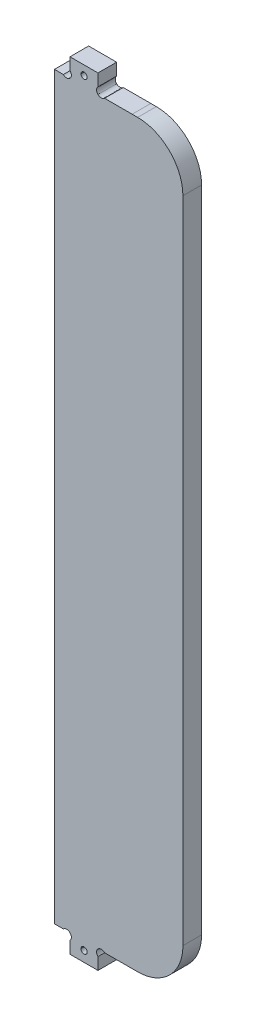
ISO-10303-21;
HEADER;
FILE_DESCRIPTION(('STEP AP214'),'2;1');
FILE_NAME('part.step','',(''),(''),'','','');
FILE_SCHEMA(('AUTOMOTIVE_DESIGN { 1 0 10303 214 1 1 1 1 }'));
ENDSEC;
DATA;
#1=APPLICATION_CONTEXT('core data for automotive mechanical design processes');
#2=APPLICATION_PROTOCOL_DEFINITION('international standard','automotive_design',2000,#1);
#3=PRODUCT_CONTEXT('',#1,'mechanical');
#4=PRODUCT('Part','Part','',(#3));
#5=PRODUCT_RELATED_PRODUCT_CATEGORY('part','',(#4));
#6=PRODUCT_DEFINITION_FORMATION('','',#4);
#7=PRODUCT_DEFINITION_CONTEXT('part definition',#1,'design');
#8=PRODUCT_DEFINITION('design','',#6,#7);
#9=PRODUCT_DEFINITION_SHAPE('','',#8);
#10=(LENGTH_UNIT() NAMED_UNIT(*) SI_UNIT(.MILLI.,.METRE.));
#11=(NAMED_UNIT(*) PLANE_ANGLE_UNIT() SI_UNIT($,.RADIAN.));
#12=(NAMED_UNIT(*) SI_UNIT($,.STERADIAN.) SOLID_ANGLE_UNIT());
#13=UNCERTAINTY_MEASURE_WITH_UNIT(LENGTH_MEASURE(1.E-05),#10,'distance_accuracy_value','');
#14=(GEOMETRIC_REPRESENTATION_CONTEXT(3) GLOBAL_UNCERTAINTY_ASSIGNED_CONTEXT((#13)) GLOBAL_UNIT_ASSIGNED_CONTEXT((#10,
#11,#12)) REPRESENTATION_CONTEXT('',''));
#15=CARTESIAN_POINT('',(0.,0.,0.));
#16=DIRECTION('',(0.,0.,1.));
#17=DIRECTION('',(1.,0.,0.));
#18=AXIS2_PLACEMENT_3D('',#15,#16,#17);
#19=CARTESIAN_POINT('',(2432.48436921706,-179.23610385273,6.));
#20=CARTESIAN_POINT('',(2432.48436921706,-178.683819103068,6.));
#21=CARTESIAN_POINT('',(2432.93208446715,-178.23610385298,6.));
#22=CARTESIAN_POINT('',(2434.03665396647,-178.23610385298,6.));
#23=CARTESIAN_POINT('',(2434.48436921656,-178.683819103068,6.));
#24=CARTESIAN_POINT('',(2434.48436921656,-179.23610385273,6.));
#25=B_SPLINE_CURVE_WITH_KNOTS('',3,(#19,#20,#21,#22,#23,#24),.UNSPECIFIED.,.F.,.F.,(4,2,4),(2.,
3.,4.),.UNSPECIFIED.);
#26=DIRECTION('',(0.,0.,-1.));
#27=VECTOR('',#26,1.);
#28=SURFACE_OF_LINEAR_EXTRUSION('',#25,#27);
#29=CARTESIAN_POINT('',(2432.48436921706,-179.23610385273,0.));
#30=CARTESIAN_POINT('',(2432.48436921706,-178.683819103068,0.));
#31=CARTESIAN_POINT('',(2432.93208446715,-178.23610385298,0.));
#32=CARTESIAN_POINT('',(2434.03665396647,-178.23610385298,0.));
#33=CARTESIAN_POINT('',(2434.48436921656,-178.683819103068,0.));
#34=CARTESIAN_POINT('',(2434.48436921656,-179.23610385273,0.));
#35=B_SPLINE_CURVE_WITH_KNOTS('',3,(#29,#30,#31,#32,#33,#34),.UNSPECIFIED.,.F.,.F.,(4,2,4),(2.,
3.,4.),.UNSPECIFIED.);
#36=CARTESIAN_POINT('',(2432.48436921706,-179.23610385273,0.));
#37=VERTEX_POINT('',#36);
#38=CARTESIAN_POINT('',(2434.48436921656,-179.23610385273,0.));
#39=VERTEX_POINT('',#38);
#40=EDGE_CURVE('E316',#37,#39,#35,.T.);
#41=ORIENTED_EDGE('',*,*,#40,.T.);
#42=DIRECTION('',(0.,0.,-1.));
#43=VECTOR('',#42,1.);
#44=CARTESIAN_POINT('',(2434.48436921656,-179.23610385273,6.));
#45=LINE('',#44,#43);
#46=CARTESIAN_POINT('',(2434.48436921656,-179.23610385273,6.));
#47=VERTEX_POINT('',#46);
#48=EDGE_CURVE('E11',#47,#39,#45,.T.);
#49=ORIENTED_EDGE('',*,*,#48,.F.);
#50=CARTESIAN_POINT('',(2432.48436921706,-179.23610385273,6.));
#51=VERTEX_POINT('',#50);
#52=EDGE_CURVE('E231',#51,#47,#25,.T.);
#53=ORIENTED_EDGE('',*,*,#52,.F.);
#54=DIRECTION('',(0.,0.,-1.));
#55=VECTOR('',#54,1.);
#56=CARTESIAN_POINT('',(2432.48436921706,-179.23610385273,6.));
#57=LINE('',#56,#55);
#58=EDGE_CURVE('E47',#51,#37,#57,.T.);
#59=ORIENTED_EDGE('',*,*,#58,.T.);
#60=EDGE_LOOP('',(#41,#49,#53,#59));
#61=FACE_BOUND('',#60,.T.);
#62=ADVANCED_FACE('F36',(#61),#28,.F.);
#63=CARTESIAN_POINT('',(2432.48436921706,64.4111833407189,6.));
#64=CARTESIAN_POINT('',(2432.48436921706,64.9634680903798,6.));
#65=CARTESIAN_POINT('',(2432.93208446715,65.411183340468,6.));
#66=CARTESIAN_POINT('',(2434.03665396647,65.411183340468,6.));
#67=CARTESIAN_POINT('',(2434.48436921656,64.9634680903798,6.));
#68=CARTESIAN_POINT('',(2434.48436921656,64.4111833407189,6.));
#69=B_SPLINE_CURVE_WITH_KNOTS('',3,(#63,#64,#65,#66,#67,#68),.UNSPECIFIED.,.F.,.F.,(4,2,4),(2.,
3.,4.),.UNSPECIFIED.);
#70=DIRECTION('',(0.,0.,-1.));
#71=VECTOR('',#70,1.);
#72=SURFACE_OF_LINEAR_EXTRUSION('',#69,#71);
#73=CARTESIAN_POINT('',(2432.48436921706,64.4111833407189,0.));
#74=CARTESIAN_POINT('',(2432.48436921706,64.9634680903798,0.));
#75=CARTESIAN_POINT('',(2432.93208446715,65.411183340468,0.));
#76=CARTESIAN_POINT('',(2434.03665396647,65.411183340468,0.));
#77=CARTESIAN_POINT('',(2434.48436921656,64.9634680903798,0.));
#78=CARTESIAN_POINT('',(2434.48436921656,64.4111833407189,0.));
#79=B_SPLINE_CURVE_WITH_KNOTS('',3,(#73,#74,#75,#76,#77,#78),.UNSPECIFIED.,.F.,.F.,(4,2,4),(2.,
3.,4.),.UNSPECIFIED.);
#80=CARTESIAN_POINT('',(2432.48436921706,64.4111833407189,0.));
#81=VERTEX_POINT('',#80);
#82=CARTESIAN_POINT('',(2434.48436921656,64.4111833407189,0.));
#83=VERTEX_POINT('',#82);
#84=EDGE_CURVE('E528',#81,#83,#79,.T.);
#85=ORIENTED_EDGE('',*,*,#84,.T.);
#86=DIRECTION('',(0.,0.,-1.));
#87=VECTOR('',#86,1.);
#88=CARTESIAN_POINT('',(2434.48436921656,64.4111833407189,6.));
#89=LINE('',#88,#87);
#90=CARTESIAN_POINT('',(2434.48436921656,64.4111833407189,6.));
#91=VERTEX_POINT('',#90);
#92=EDGE_CURVE('E240',#91,#83,#89,.T.);
#93=ORIENTED_EDGE('',*,*,#92,.F.);
#94=CARTESIAN_POINT('',(2432.48436921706,64.4111833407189,6.));
#95=VERTEX_POINT('',#94);
#96=EDGE_CURVE('E227',#95,#91,#69,.T.);
#97=ORIENTED_EDGE('',*,*,#96,.F.);
#98=DIRECTION('',(0.,0.,-1.));
#99=VECTOR('',#98,1.);
#100=CARTESIAN_POINT('',(2432.48436921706,64.4111833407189,6.));
#101=LINE('',#100,#99);
#102=EDGE_CURVE('E234',#95,#81,#101,.T.);
#103=ORIENTED_EDGE('',*,*,#102,.T.);
#104=EDGE_LOOP('',(#85,#93,#97,#103));
#105=FACE_BOUND('',#104,.T.);
#106=ADVANCED_FACE('F242',(#105),#72,.F.);
#107=CARTESIAN_POINT('',(2440.0769720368,61.4112591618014,6.));
#108=CARTESIAN_POINT('',(2439.49117661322,60.8254206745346,6.));
#109=CARTESIAN_POINT('',(2438.54142838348,60.8254206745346,6.));
#110=CARTESIAN_POINT('',(2437.95565449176,61.4112591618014,6.));
#111=B_SPLINE_CURVE_WITH_KNOTS('',3,(#107,#108,#109,#110),.UNSPECIFIED.,.F.,.F.,(4,4),(27.,28.),.UNSPECIFIED.);
#112=DIRECTION('',(0.,0.,-1.));
#113=VECTOR('',#112,1.);
#114=SURFACE_OF_LINEAR_EXTRUSION('',#111,#113);
#115=CARTESIAN_POINT('',(2440.0769720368,61.4112591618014,0.));
#116=CARTESIAN_POINT('',(2439.49117661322,60.8254206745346,0.));
#117=CARTESIAN_POINT('',(2438.54142838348,60.8254206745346,0.));
#118=CARTESIAN_POINT('',(2437.95565449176,61.4112591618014,0.));
#119=B_SPLINE_CURVE_WITH_KNOTS('',3,(#115,#116,#117,#118),.UNSPECIFIED.,.F.,.F.,(4,4),(27.,28.),.UNSPECIFIED.);
#120=CARTESIAN_POINT('',(2440.0769720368,61.4112591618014,0.));
#121=VERTEX_POINT('',#120);
#122=CARTESIAN_POINT('',(2437.95565449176,61.4112591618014,0.));
#123=VERTEX_POINT('',#122);
#124=EDGE_CURVE('E431',#121,#123,#119,.T.);
#125=ORIENTED_EDGE('',*,*,#124,.T.);
#126=DIRECTION('',(0.,0.,-1.));
#127=VECTOR('',#126,1.);
#128=CARTESIAN_POINT('',(2437.95565449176,61.4112591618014,6.));
#129=LINE('',#128,#127);
#130=CARTESIAN_POINT('',(2437.95565449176,61.4112591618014,6.));
#131=VERTEX_POINT('',#130);
#132=EDGE_CURVE('E41',#131,#123,#129,.T.);
#133=ORIENTED_EDGE('',*,*,#132,.F.);
#134=CARTESIAN_POINT('',(2440.0769720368,61.4112591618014,6.));
#135=VERTEX_POINT('',#134);
#136=EDGE_CURVE('E313',#135,#131,#111,.T.);
#137=ORIENTED_EDGE('',*,*,#136,.F.);
#138=DIRECTION('',(0.,0.,-1.));
#139=VECTOR('',#138,1.);
#140=CARTESIAN_POINT('',(2440.0769720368,61.4112591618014,6.));
#141=LINE('',#140,#139);
#142=EDGE_CURVE('E303',#135,#121,#141,.T.);
#143=ORIENTED_EDGE('',*,*,#142,.T.);
#144=EDGE_LOOP('',(#125,#133,#137,#143));
#145=FACE_BOUND('',#144,.T.);
#146=ADVANCED_FACE('F38',(#145),#114,.F.);
#147=CARTESIAN_POINT('',(2437.95565449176,61.4112591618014,6.));
#148=CARTESIAN_POINT('',(2437.36985906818,61.9969253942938,6.));
#149=CARTESIAN_POINT('',(2437.36985906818,62.9467382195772,6.));
#150=CARTESIAN_POINT('',(2437.95565449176,63.5324044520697,6.));
#151=B_SPLINE_CURVE_WITH_KNOTS('',3,(#147,#148,#149,#150),.UNSPECIFIED.,.F.,.F.,(4,4),(28.,29.),.UNSPECIFIED.);
#152=DIRECTION('',(0.,0.,-1.));
#153=VECTOR('',#152,1.);
#154=SURFACE_OF_LINEAR_EXTRUSION('',#151,#153);
#155=CARTESIAN_POINT('',(2437.95565449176,61.4112591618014,0.));
#156=CARTESIAN_POINT('',(2437.36985906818,61.9969253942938,0.));
#157=CARTESIAN_POINT('',(2437.36985906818,62.9467382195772,0.));
#158=CARTESIAN_POINT('',(2437.95565449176,63.5324044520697,0.));
#159=B_SPLINE_CURVE_WITH_KNOTS('',3,(#155,#156,#157,#158),.UNSPECIFIED.,.F.,.F.,(4,4),(28.,29.),.UNSPECIFIED.);
#160=CARTESIAN_POINT('',(2437.95565449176,63.5324044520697,0.));
#161=VERTEX_POINT('',#160);
#162=EDGE_CURVE('E438',#123,#161,#159,.T.);
#163=ORIENTED_EDGE('',*,*,#162,.T.);
#164=DIRECTION('',(0.,0.,-1.));
#165=VECTOR('',#164,1.);
#166=CARTESIAN_POINT('',(2437.95565449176,63.5324044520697,6.));
#167=LINE('',#166,#165);
#168=CARTESIAN_POINT('',(2437.95565449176,63.5324044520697,6.));
#169=VERTEX_POINT('',#168);
#170=EDGE_CURVE('E608',#169,#161,#167,.T.);
#171=ORIENTED_EDGE('',*,*,#170,.F.);
#172=EDGE_CURVE('E151',#131,#169,#151,.T.);
#173=ORIENTED_EDGE('',*,*,#172,.F.);
#174=ORIENTED_EDGE('',*,*,#132,.T.);
#175=EDGE_LOOP('',(#163,#171,#173,#174));
#176=FACE_BOUND('',#175,.T.);
#177=ADVANCED_FACE('F332',(#176),#154,.F.);
#178=CARTESIAN_POINT('',(2437.95565449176,0.,6.));
#179=DIRECTION('',(-1.,0.,0.));
#180=DIRECTION('',(0.,0.,1.));
#181=AXIS2_PLACEMENT_3D('',#178,#179,#180);
#182=PLANE('',#181);
#183=DIRECTION('',(0.,1.,0.));
#184=VECTOR('',#183,1.);
#185=CARTESIAN_POINT('',(2437.95565449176,0.,0.));
#186=LINE('',#185,#184);
#187=CARTESIAN_POINT('',(2437.95565449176,67.4112374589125,0.));
#188=VERTEX_POINT('',#187);
#189=EDGE_CURVE('E445',#161,#188,#186,.T.);
#190=ORIENTED_EDGE('',*,*,#189,.T.);
#191=DIRECTION('',(0.,0.,-1.));
#192=VECTOR('',#191,1.);
#193=CARTESIAN_POINT('',(2437.95565449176,67.4112374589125,6.));
#194=LINE('',#193,#192);
#195=CARTESIAN_POINT('',(2437.95565449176,67.4112374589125,6.));
#196=VERTEX_POINT('',#195);
#197=EDGE_CURVE('E606',#196,#188,#194,.T.);
#198=ORIENTED_EDGE('',*,*,#197,.F.);
#199=DIRECTION('',(0.,1.,0.));
#200=VECTOR('',#199,1.);
#201=CARTESIAN_POINT('',(2437.95565449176,0.,6.));
#202=LINE('',#201,#200);
#203=EDGE_CURVE('E314',#169,#196,#202,.T.);
#204=ORIENTED_EDGE('',*,*,#203,.F.);
#205=ORIENTED_EDGE('',*,*,#170,.T.);
#206=EDGE_LOOP('',(#190,#198,#204,#205));
#207=FACE_BOUND('',#206,.T.);
#208=ADVANCED_FACE('F335',(#207),#182,.F.);
#209=CARTESIAN_POINT('',(0.,67.4112374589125,6.));
#210=DIRECTION('',(0.,-1.,0.));
#211=DIRECTION('',(0.,0.,-1.));
#212=AXIS2_PLACEMENT_3D('',#209,#210,#211);
#213=PLANE('',#212);
#214=DIRECTION('',(-1.,0.,0.));
#215=VECTOR('',#214,1.);
#216=CARTESIAN_POINT('',(0.,67.4112374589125,0.));
#217=LINE('',#216,#215);
#218=CARTESIAN_POINT('',(2428.95566551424,67.4112374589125,0.));
#219=VERTEX_POINT('',#218);
#220=EDGE_CURVE('E450',#188,#219,#217,.T.);
#221=ORIENTED_EDGE('',*,*,#220,.T.);
#222=DIRECTION('',(0.,0.,-1.));
#223=VECTOR('',#222,1.);
#224=CARTESIAN_POINT('',(2428.95566551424,67.4112374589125,6.));
#225=LINE('',#224,#223);
#226=CARTESIAN_POINT('',(2428.95566551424,67.4112374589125,6.));
#227=VERTEX_POINT('',#226);
#228=EDGE_CURVE('E603',#227,#219,#225,.T.);
#229=ORIENTED_EDGE('',*,*,#228,.F.);
#230=DIRECTION('',(-1.,0.,0.));
#231=VECTOR('',#230,1.);
#232=CARTESIAN_POINT('',(0.,67.4112374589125,6.));
#233=LINE('',#232,#231);
#234=EDGE_CURVE('E620',#196,#227,#233,.T.);
#235=ORIENTED_EDGE('',*,*,#234,.F.);
#236=ORIENTED_EDGE('',*,*,#197,.T.);
#237=EDGE_LOOP('',(#221,#229,#235,#236));
#238=FACE_BOUND('',#237,.T.);
#239=ADVANCED_FACE('F338',(#238),#213,.F.);
#240=CARTESIAN_POINT('',(2428.95566551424,0.,6.));
#241=DIRECTION('',(1.,0.,0.));
#242=DIRECTION('',(0.,0.,-1.));
#243=AXIS2_PLACEMENT_3D('',#240,#241,#242);
#244=PLANE('',#243);
#245=DIRECTION('',(0.,-1.,0.));
#246=VECTOR('',#245,1.);
#247=CARTESIAN_POINT('',(2428.95566551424,0.,0.));
#248=LINE('',#247,#246);
#249=CARTESIAN_POINT('',(2428.95566551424,63.5324044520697,0.));
#250=VERTEX_POINT('',#249);
#251=EDGE_CURVE('E452',#219,#250,#248,.T.);
#252=ORIENTED_EDGE('',*,*,#251,.T.);
#253=DIRECTION('',(0.,0.,-1.));
#254=VECTOR('',#253,1.);
#255=CARTESIAN_POINT('',(2428.95566551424,63.5324044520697,6.));
#256=LINE('',#255,#254);
#257=CARTESIAN_POINT('',(2428.95566551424,63.5324044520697,6.));
#258=VERTEX_POINT('',#257);
#259=EDGE_CURVE('E600',#258,#250,#256,.T.);
#260=ORIENTED_EDGE('',*,*,#259,.F.);
#261=DIRECTION('',(0.,-1.,0.));
#262=VECTOR('',#261,1.);
#263=CARTESIAN_POINT('',(2428.95566551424,0.,6.));
#264=LINE('',#263,#262);
#265=EDGE_CURVE('E361',#227,#258,#264,.T.);
#266=ORIENTED_EDGE('',*,*,#265,.F.);
#267=ORIENTED_EDGE('',*,*,#228,.T.);
#268=EDGE_LOOP('',(#252,#260,#266,#267));
#269=FACE_BOUND('',#268,.T.);
#270=ADVANCED_FACE('F342',(#269),#244,.F.);
#271=CARTESIAN_POINT('',(2428.95566551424,63.5324044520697,6.));
#272=CARTESIAN_POINT('',(2429.54143940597,62.9467382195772,6.));
#273=CARTESIAN_POINT('',(2429.54143940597,61.9969253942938,6.));
#274=CARTESIAN_POINT('',(2428.95566551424,61.4112591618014,6.));
#275=B_SPLINE_CURVE_WITH_KNOTS('',3,(#271,#272,#273,#274),.UNSPECIFIED.,.F.,.F.,(4,4),(0.,1.),.UNSPECIFIED.);
#276=DIRECTION('',(0.,0.,-1.));
#277=VECTOR('',#276,1.);
#278=SURFACE_OF_LINEAR_EXTRUSION('',#275,#277);
#279=CARTESIAN_POINT('',(2428.95566551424,63.5324044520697,0.));
#280=CARTESIAN_POINT('',(2429.54143940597,62.9467382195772,0.));
#281=CARTESIAN_POINT('',(2429.54143940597,61.9969253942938,0.));
#282=CARTESIAN_POINT('',(2428.95566551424,61.4112591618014,0.));
#283=B_SPLINE_CURVE_WITH_KNOTS('',3,(#279,#280,#281,#282),.UNSPECIFIED.,.F.,.F.,(4,4),(0.,1.),.UNSPECIFIED.);
#284=CARTESIAN_POINT('',(2428.95566551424,61.4112591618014,0.));
#285=VERTEX_POINT('',#284);
#286=EDGE_CURVE('E454',#250,#285,#283,.T.);
#287=ORIENTED_EDGE('',*,*,#286,.T.);
#288=DIRECTION('',(0.,0.,-1.));
#289=VECTOR('',#288,1.);
#290=CARTESIAN_POINT('',(2428.95566551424,61.4112591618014,6.));
#291=LINE('',#290,#289);
#292=CARTESIAN_POINT('',(2428.95566551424,61.4112591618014,6.));
#293=VERTEX_POINT('',#292);
#294=EDGE_CURVE('E597',#293,#285,#291,.T.);
#295=ORIENTED_EDGE('',*,*,#294,.F.);
#296=EDGE_CURVE('E355',#258,#293,#275,.T.);
#297=ORIENTED_EDGE('',*,*,#296,.F.);
#298=ORIENTED_EDGE('',*,*,#259,.T.);
#299=EDGE_LOOP('',(#287,#295,#297,#298));
#300=FACE_BOUND('',#299,.T.);
#301=ADVANCED_FACE('F346',(#300),#278,.F.);
#302=CARTESIAN_POINT('',(2428.95566551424,61.4112591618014,6.));
#303=CARTESIAN_POINT('',(2428.36987009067,60.8254206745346,6.));
#304=CARTESIAN_POINT('',(2427.42012186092,60.8254206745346,6.));
#305=CARTESIAN_POINT('',(2426.83434796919,61.4112591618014,6.));
#306=B_SPLINE_CURVE_WITH_KNOTS('',3,(#302,#303,#304,#305),.UNSPECIFIED.,.F.,.F.,(4,4),(1.,2.),.UNSPECIFIED.);
#307=DIRECTION('',(0.,0.,-1.));
#308=VECTOR('',#307,1.);
#309=SURFACE_OF_LINEAR_EXTRUSION('',#306,#308);
#310=CARTESIAN_POINT('',(2428.95566551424,61.4112591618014,0.));
#311=CARTESIAN_POINT('',(2428.36987009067,60.8254206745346,0.));
#312=CARTESIAN_POINT('',(2427.42012186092,60.8254206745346,0.));
#313=CARTESIAN_POINT('',(2426.83434796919,61.4112591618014,0.));
#314=B_SPLINE_CURVE_WITH_KNOTS('',3,(#310,#311,#312,#313),.UNSPECIFIED.,.F.,.F.,(4,4),(1.,2.),.UNSPECIFIED.);
#315=CARTESIAN_POINT('',(2426.83434796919,61.4112591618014,0.));
#316=VERTEX_POINT('',#315);
#317=EDGE_CURVE('E458',#285,#316,#314,.T.);
#318=ORIENTED_EDGE('',*,*,#317,.T.);
#319=DIRECTION('',(0.,0.,-1.));
#320=VECTOR('',#319,1.);
#321=CARTESIAN_POINT('',(2426.83434796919,61.4112591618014,6.));
#322=LINE('',#321,#320);
#323=CARTESIAN_POINT('',(2426.83434796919,61.4112591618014,6.));
#324=VERTEX_POINT('',#323);
#325=EDGE_CURVE('E594',#324,#316,#322,.T.);
#326=ORIENTED_EDGE('',*,*,#325,.F.);
#327=EDGE_CURVE('E360',#293,#324,#306,.T.);
#328=ORIENTED_EDGE('',*,*,#327,.F.);
#329=ORIENTED_EDGE('',*,*,#294,.T.);
#330=EDGE_LOOP('',(#318,#326,#328,#329));
#331=FACE_BOUND('',#330,.T.);
#332=ADVANCED_FACE('F351',(#331),#309,.F.);
#333=CARTESIAN_POINT('',(0.,61.4112591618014,6.));
#334=DIRECTION('',(0.,-1.,0.));
#335=DIRECTION('',(0.,0.,-1.));
#336=AXIS2_PLACEMENT_3D('',#333,#334,#335);
#337=PLANE('',#336);
#338=DIRECTION('',(-1.,0.,0.));
#339=VECTOR('',#338,1.);
#340=CARTESIAN_POINT('',(0.,61.4112591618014,0.));
#341=LINE('',#340,#339);
#342=CARTESIAN_POINT('',(2423.95566924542,61.4112591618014,0.));
#343=VERTEX_POINT('',#342);
#344=EDGE_CURVE('E465',#316,#343,#341,.T.);
#345=ORIENTED_EDGE('',*,*,#344,.T.);
#346=DIRECTION('',(0.,0.,-1.));
#347=VECTOR('',#346,1.);
#348=CARTESIAN_POINT('',(2423.95566924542,61.4112591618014,6.));
#349=LINE('',#348,#347);
#350=CARTESIAN_POINT('',(2423.95566924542,61.4112591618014,6.));
#351=VERTEX_POINT('',#350);
#352=EDGE_CURVE('E591',#351,#343,#349,.T.);
#353=ORIENTED_EDGE('',*,*,#352,.F.);
#354=DIRECTION('',(-1.,0.,0.));
#355=VECTOR('',#354,1.);
#356=CARTESIAN_POINT('',(0.,61.4112591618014,6.));
#357=LINE('',#356,#355);
#358=EDGE_CURVE('E369',#324,#351,#357,.T.);
#359=ORIENTED_EDGE('',*,*,#358,.F.);
#360=ORIENTED_EDGE('',*,*,#325,.T.);
#361=EDGE_LOOP('',(#345,#353,#359,#360));
#362=FACE_BOUND('',#361,.T.);
#363=ADVANCED_FACE('F405',(#362),#337,.F.);
#364=CARTESIAN_POINT('',(2423.95566924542,0.,6.));
#365=DIRECTION('',(1.,0.,0.));
#366=DIRECTION('',(0.,0.,-1.));
#367=AXIS2_PLACEMENT_3D('',#364,#365,#366);
#368=PLANE('',#367);
#369=DIRECTION('',(0.,-1.,0.));
#370=VECTOR('',#369,1.);
#371=CARTESIAN_POINT('',(2423.95566924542,0.,0.));
#372=LINE('',#371,#370);
#373=CARTESIAN_POINT('',(2423.95566924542,-176.588856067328,0.));
#374=VERTEX_POINT('',#373);
#375=EDGE_CURVE('E470',#343,#374,#372,.T.);
#376=ORIENTED_EDGE('',*,*,#375,.T.);
#377=DIRECTION('',(0.,0.,-1.));
#378=VECTOR('',#377,1.);
#379=CARTESIAN_POINT('',(2423.95566924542,-176.588856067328,6.));
#380=LINE('',#379,#378);
#381=CARTESIAN_POINT('',(2423.95566924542,-176.588856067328,6.));
#382=VERTEX_POINT('',#381);
#383=EDGE_CURVE('E588',#382,#374,#380,.T.);
#384=ORIENTED_EDGE('',*,*,#383,.F.);
#385=DIRECTION('',(0.,-1.,0.));
#386=VECTOR('',#385,1.);
#387=CARTESIAN_POINT('',(2423.95566924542,0.,6.));
#388=LINE('',#387,#386);
#389=EDGE_CURVE('E374',#351,#382,#388,.T.);
#390=ORIENTED_EDGE('',*,*,#389,.F.);
#391=ORIENTED_EDGE('',*,*,#352,.T.);
#392=EDGE_LOOP('',(#376,#384,#390,#391));
#393=FACE_BOUND('',#392,.T.);
#394=ADVANCED_FACE('F402',(#393),#368,.F.);
#395=CARTESIAN_POINT('',(0.,-176.588856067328,6.));
#396=DIRECTION('',(0.,1.,0.));
#397=DIRECTION('',(0.,0.,1.));
#398=AXIS2_PLACEMENT_3D('',#395,#396,#397);
#399=PLANE('',#398);
#400=DIRECTION('',(1.,0.,0.));
#401=VECTOR('',#400,1.);
#402=CARTESIAN_POINT('',(0.,-176.588856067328,0.));
#403=LINE('',#402,#401);
#404=CARTESIAN_POINT('',(2426.83434796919,-176.588856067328,0.));
#405=VERTEX_POINT('',#404);
#406=EDGE_CURVE('E472',#374,#405,#403,.T.);
#407=ORIENTED_EDGE('',*,*,#406,.T.);
#408=DIRECTION('',(0.,0.,-1.));
#409=VECTOR('',#408,1.);
#410=CARTESIAN_POINT('',(2426.83434796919,-176.588856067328,6.));
#411=LINE('',#410,#409);
#412=CARTESIAN_POINT('',(2426.83434796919,-176.588856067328,6.));
#413=VERTEX_POINT('',#412);
#414=EDGE_CURVE('E585',#413,#405,#411,.T.);
#415=ORIENTED_EDGE('',*,*,#414,.F.);
#416=DIRECTION('',(1.,0.,0.));
#417=VECTOR('',#416,1.);
#418=CARTESIAN_POINT('',(0.,-176.588856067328,6.));
#419=LINE('',#418,#417);
#420=EDGE_CURVE('E376',#382,#413,#419,.T.);
#421=ORIENTED_EDGE('',*,*,#420,.F.);
#422=ORIENTED_EDGE('',*,*,#383,.T.);
#423=EDGE_LOOP('',(#407,#415,#421,#422));
#424=FACE_BOUND('',#423,.T.);
#425=ADVANCED_FACE('F397',(#424),#399,.F.);
#426=CARTESIAN_POINT('',(2426.83434796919,-176.588856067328,6.));
#427=CARTESIAN_POINT('',(2427.42012186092,-176.003017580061,6.));
#428=CARTESIAN_POINT('',(2428.36987009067,-176.003017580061,6.));
#429=CARTESIAN_POINT('',(2428.95566551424,-176.588856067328,6.));
#430=B_SPLINE_CURVE_WITH_KNOTS('',3,(#426,#427,#428,#429),.UNSPECIFIED.,.F.,.F.,(4,4),(7.,8.),.UNSPECIFIED.);
#431=DIRECTION('',(0.,0.,-1.));
#432=VECTOR('',#431,1.);
#433=SURFACE_OF_LINEAR_EXTRUSION('',#430,#432);
#434=CARTESIAN_POINT('',(2426.83434796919,-176.588856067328,0.));
#435=CARTESIAN_POINT('',(2427.42012186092,-176.003017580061,0.));
#436=CARTESIAN_POINT('',(2428.36987009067,-176.003017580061,0.));
#437=CARTESIAN_POINT('',(2428.95566551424,-176.588856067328,0.));
#438=B_SPLINE_CURVE_WITH_KNOTS('',3,(#434,#435,#436,#437),.UNSPECIFIED.,.F.,.F.,(4,4),(7.,8.),.UNSPECIFIED.);
#439=CARTESIAN_POINT('',(2428.95566551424,-176.588856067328,0.));
#440=VERTEX_POINT('',#439);
#441=EDGE_CURVE('E474',#405,#440,#438,.T.);
#442=ORIENTED_EDGE('',*,*,#441,.T.);
#443=DIRECTION('',(0.,0.,-1.));
#444=VECTOR('',#443,1.);
#445=CARTESIAN_POINT('',(2428.95566551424,-176.588856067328,6.));
#446=LINE('',#445,#444);
#447=CARTESIAN_POINT('',(2428.95566551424,-176.588856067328,6.));
#448=VERTEX_POINT('',#447);
#449=EDGE_CURVE('E582',#448,#440,#446,.T.);
#450=ORIENTED_EDGE('',*,*,#449,.F.);
#451=EDGE_CURVE('E378',#413,#448,#430,.T.);
#452=ORIENTED_EDGE('',*,*,#451,.F.);
#453=ORIENTED_EDGE('',*,*,#414,.T.);
#454=EDGE_LOOP('',(#442,#450,#452,#453));
#455=FACE_BOUND('',#454,.T.);
#456=ADVANCED_FACE('F392',(#455),#433,.F.);
#457=CARTESIAN_POINT('',(2428.95566551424,-176.588856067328,6.));
#458=CARTESIAN_POINT('',(2429.54143940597,-177.174694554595,6.));
#459=CARTESIAN_POINT('',(2429.54143940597,-178.124335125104,6.));
#460=CARTESIAN_POINT('',(2428.95566551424,-178.71017361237,6.));
#461=B_SPLINE_CURVE_WITH_KNOTS('',3,(#457,#458,#459,#460),.UNSPECIFIED.,.F.,.F.,(4,4),(8.,9.),.UNSPECIFIED.);
#462=DIRECTION('',(0.,0.,-1.));
#463=VECTOR('',#462,1.);
#464=SURFACE_OF_LINEAR_EXTRUSION('',#461,#463);
#465=CARTESIAN_POINT('',(2428.95566551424,-176.588856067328,0.));
#466=CARTESIAN_POINT('',(2429.54143940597,-177.174694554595,0.));
#467=CARTESIAN_POINT('',(2429.54143940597,-178.124335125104,0.));
#468=CARTESIAN_POINT('',(2428.95566551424,-178.71017361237,0.));
#469=B_SPLINE_CURVE_WITH_KNOTS('',3,(#465,#466,#467,#468),.UNSPECIFIED.,.F.,.F.,(4,4),(8.,9.),.UNSPECIFIED.);
#470=CARTESIAN_POINT('',(2428.95566551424,-178.71017361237,0.));
#471=VERTEX_POINT('',#470);
#472=EDGE_CURVE('E478',#440,#471,#469,.T.);
#473=ORIENTED_EDGE('',*,*,#472,.T.);
#474=DIRECTION('',(0.,0.,-1.));
#475=VECTOR('',#474,1.);
#476=CARTESIAN_POINT('',(2428.95566551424,-178.71017361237,6.));
#477=LINE('',#476,#475);
#478=CARTESIAN_POINT('',(2428.95566551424,-178.71017361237,6.));
#479=VERTEX_POINT('',#478);
#480=EDGE_CURVE('E579',#479,#471,#477,.T.);
#481=ORIENTED_EDGE('',*,*,#480,.F.);
#482=EDGE_CURVE('E383',#448,#479,#461,.T.);
#483=ORIENTED_EDGE('',*,*,#482,.F.);
#484=ORIENTED_EDGE('',*,*,#449,.T.);
#485=EDGE_LOOP('',(#473,#481,#483,#484));
#486=FACE_BOUND('',#485,.T.);
#487=ADVANCED_FACE('F396',(#486),#464,.F.);
#488=CARTESIAN_POINT('',(2428.95566551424,0.,6.));
#489=DIRECTION('',(1.,0.,0.));
#490=DIRECTION('',(0.,0.,-1.));
#491=AXIS2_PLACEMENT_3D('',#488,#489,#490);
#492=PLANE('',#491);
#493=DIRECTION('',(0.,-1.,0.));
#494=VECTOR('',#493,1.);
#495=CARTESIAN_POINT('',(2428.95566551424,0.,0.));
#496=LINE('',#495,#494);
#497=CARTESIAN_POINT('',(2428.95566551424,-182.588834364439,0.));
#498=VERTEX_POINT('',#497);
#499=EDGE_CURVE('E485',#471,#498,#496,.T.);
#500=ORIENTED_EDGE('',*,*,#499,.T.);
#501=DIRECTION('',(0.,0.,-1.));
#502=VECTOR('',#501,1.);
#503=CARTESIAN_POINT('',(2428.95566551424,-182.588834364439,6.));
#504=LINE('',#503,#502);
#505=CARTESIAN_POINT('',(2428.95566551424,-182.588834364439,6.));
#506=VERTEX_POINT('',#505);
#507=EDGE_CURVE('E576',#506,#498,#504,.T.);
#508=ORIENTED_EDGE('',*,*,#507,.F.);
#509=DIRECTION('',(0.,-1.,0.));
#510=VECTOR('',#509,1.);
#511=CARTESIAN_POINT('',(2428.95566551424,0.,6.));
#512=LINE('',#511,#510);
#513=EDGE_CURVE('E646',#479,#506,#512,.T.);
#514=ORIENTED_EDGE('',*,*,#513,.F.);
#515=ORIENTED_EDGE('',*,*,#480,.T.);
#516=EDGE_LOOP('',(#500,#508,#514,#515));
#517=FACE_BOUND('',#516,.T.);
#518=ADVANCED_FACE('F680',(#517),#492,.F.);
#519=CARTESIAN_POINT('',(0.,-182.588834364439,6.));
#520=DIRECTION('',(0.,1.,0.));
#521=DIRECTION('',(0.,0.,1.));
#522=AXIS2_PLACEMENT_3D('',#519,#520,#521);
#523=PLANE('',#522);
#524=DIRECTION('',(1.,0.,0.));
#525=VECTOR('',#524,1.);
#526=CARTESIAN_POINT('',(0.,-182.588834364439,0.));
#527=LINE('',#526,#525);
#528=CARTESIAN_POINT('',(2437.95565449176,-182.588834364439,0.));
#529=VERTEX_POINT('',#528);
#530=EDGE_CURVE('E490',#498,#529,#527,.T.);
#531=ORIENTED_EDGE('',*,*,#530,.T.);
#532=DIRECTION('',(0.,0.,-1.));
#533=VECTOR('',#532,1.);
#534=CARTESIAN_POINT('',(2437.95565449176,-182.588834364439,6.));
#535=LINE('',#534,#533);
#536=CARTESIAN_POINT('',(2437.95565449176,-182.588834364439,6.));
#537=VERTEX_POINT('',#536);
#538=EDGE_CURVE('E573',#537,#529,#535,.T.);
#539=ORIENTED_EDGE('',*,*,#538,.F.);
#540=DIRECTION('',(1.,0.,0.));
#541=VECTOR('',#540,1.);
#542=CARTESIAN_POINT('',(0.,-182.588834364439,6.));
#543=LINE('',#542,#541);
#544=EDGE_CURVE('E647',#506,#537,#543,.T.);
#545=ORIENTED_EDGE('',*,*,#544,.F.);
#546=ORIENTED_EDGE('',*,*,#507,.T.);
#547=EDGE_LOOP('',(#531,#539,#545,#546));
#548=FACE_BOUND('',#547,.T.);
#549=ADVANCED_FACE('F677',(#548),#523,.F.);
#550=CARTESIAN_POINT('',(2437.95565449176,0.,6.));
#551=DIRECTION('',(-1.,0.,0.));
#552=DIRECTION('',(0.,0.,1.));
#553=AXIS2_PLACEMENT_3D('',#550,#551,#552);
#554=PLANE('',#553);
#555=DIRECTION('',(0.,1.,0.));
#556=VECTOR('',#555,1.);
#557=CARTESIAN_POINT('',(2437.95565449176,0.,0.));
#558=LINE('',#557,#556);
#559=CARTESIAN_POINT('',(2437.95565449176,-178.71017361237,0.));
#560=VERTEX_POINT('',#559);
#561=EDGE_CURVE('E492',#529,#560,#558,.T.);
#562=ORIENTED_EDGE('',*,*,#561,.T.);
#563=DIRECTION('',(0.,0.,-1.));
#564=VECTOR('',#563,1.);
#565=CARTESIAN_POINT('',(2437.95565449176,-178.71017361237,6.));
#566=LINE('',#565,#564);
#567=CARTESIAN_POINT('',(2437.95565449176,-178.71017361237,6.));
#568=VERTEX_POINT('',#567);
#569=EDGE_CURVE('E570',#568,#560,#566,.T.);
#570=ORIENTED_EDGE('',*,*,#569,.F.);
#571=DIRECTION('',(0.,1.,0.));
#572=VECTOR('',#571,1.);
#573=CARTESIAN_POINT('',(2437.95565449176,0.,6.));
#574=LINE('',#573,#572);
#575=EDGE_CURVE('E649',#537,#568,#574,.T.);
#576=ORIENTED_EDGE('',*,*,#575,.F.);
#577=ORIENTED_EDGE('',*,*,#538,.T.);
#578=EDGE_LOOP('',(#562,#570,#576,#577));
#579=FACE_BOUND('',#578,.T.);
#580=ADVANCED_FACE('F672',(#579),#554,.F.);
#581=CARTESIAN_POINT('',(2437.95565449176,-178.71017361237,6.));
#582=CARTESIAN_POINT('',(2437.36985906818,-178.124335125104,6.));
#583=CARTESIAN_POINT('',(2437.36985906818,-177.174694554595,6.));
#584=CARTESIAN_POINT('',(2437.95565449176,-176.588856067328,6.));
#585=B_SPLINE_CURVE_WITH_KNOTS('',3,(#581,#582,#583,#584),.UNSPECIFIED.,.F.,.F.,(4,4),(12.,13.),.UNSPECIFIED.);
#586=DIRECTION('',(0.,0.,-1.));
#587=VECTOR('',#586,1.);
#588=SURFACE_OF_LINEAR_EXTRUSION('',#585,#587);
#589=CARTESIAN_POINT('',(2437.95565449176,-178.71017361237,0.));
#590=CARTESIAN_POINT('',(2437.36985906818,-178.124335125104,0.));
#591=CARTESIAN_POINT('',(2437.36985906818,-177.174694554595,0.));
#592=CARTESIAN_POINT('',(2437.95565449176,-176.588856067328,0.));
#593=B_SPLINE_CURVE_WITH_KNOTS('',3,(#589,#590,#591,#592),.UNSPECIFIED.,.F.,.F.,(4,4),(12.,13.),.UNSPECIFIED.);
#594=CARTESIAN_POINT('',(2437.95565449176,-176.588856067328,0.));
#595=VERTEX_POINT('',#594);
#596=EDGE_CURVE('E494',#560,#595,#593,.T.);
#597=ORIENTED_EDGE('',*,*,#596,.T.);
#598=DIRECTION('',(0.,0.,-1.));
#599=VECTOR('',#598,1.);
#600=CARTESIAN_POINT('',(2437.95565449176,-176.588856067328,6.));
#601=LINE('',#600,#599);
#602=CARTESIAN_POINT('',(2437.95565449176,-176.588856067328,6.));
#603=VERTEX_POINT('',#602);
#604=EDGE_CURVE('E567',#603,#595,#601,.T.);
#605=ORIENTED_EDGE('',*,*,#604,.F.);
#606=EDGE_CURVE('E653',#568,#603,#585,.T.);
#607=ORIENTED_EDGE('',*,*,#606,.F.);
#608=ORIENTED_EDGE('',*,*,#569,.T.);
#609=EDGE_LOOP('',(#597,#605,#607,#608));
#610=FACE_BOUND('',#609,.T.);
#611=ADVANCED_FACE('F667',(#610),#588,.F.);
#612=CARTESIAN_POINT('',(2437.95565449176,-176.588856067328,6.));
#613=CARTESIAN_POINT('',(2438.54142838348,-176.003017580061,6.));
#614=CARTESIAN_POINT('',(2439.49117661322,-176.003017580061,6.));
#615=CARTESIAN_POINT('',(2440.07699356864,-176.588856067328,6.));
#616=B_SPLINE_CURVE_WITH_KNOTS('',3,(#612,#613,#614,#615),.UNSPECIFIED.,.F.,.F.,(4,4),(13.,14.),.UNSPECIFIED.);
#617=DIRECTION('',(0.,0.,-1.));
#618=VECTOR('',#617,1.);
#619=SURFACE_OF_LINEAR_EXTRUSION('',#616,#618);
#620=CARTESIAN_POINT('',(2437.95565449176,-176.588856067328,0.));
#621=CARTESIAN_POINT('',(2438.54142838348,-176.003017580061,0.));
#622=CARTESIAN_POINT('',(2439.49117661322,-176.003017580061,0.));
#623=CARTESIAN_POINT('',(2440.07699356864,-176.588856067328,0.));
#624=B_SPLINE_CURVE_WITH_KNOTS('',3,(#620,#621,#622,#623),.UNSPECIFIED.,.F.,.F.,(4,4),(13.,14.),.UNSPECIFIED.);
#625=CARTESIAN_POINT('',(2440.07699356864,-176.588856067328,0.));
#626=VERTEX_POINT('',#625);
#627=EDGE_CURVE('E498',#595,#626,#624,.T.);
#628=ORIENTED_EDGE('',*,*,#627,.T.);
#629=DIRECTION('',(0.,0.,-1.));
#630=VECTOR('',#629,1.);
#631=CARTESIAN_POINT('',(2440.07699356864,-176.588856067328,6.));
#632=LINE('',#631,#630);
#633=CARTESIAN_POINT('',(2440.07699356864,-176.588856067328,6.));
#634=VERTEX_POINT('',#633);
#635=EDGE_CURVE('E564',#634,#626,#632,.T.);
#636=ORIENTED_EDGE('',*,*,#635,.F.);
#637=EDGE_CURVE('E658',#603,#634,#616,.T.);
#638=ORIENTED_EDGE('',*,*,#637,.F.);
#639=ORIENTED_EDGE('',*,*,#604,.T.);
#640=EDGE_LOOP('',(#628,#636,#638,#639));
#641=FACE_BOUND('',#640,.T.);
#642=ADVANCED_FACE('F671',(#641),#619,.F.);
#643=CARTESIAN_POINT('',(0.,-176.588856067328,6.));
#644=DIRECTION('',(0.,1.,0.));
#645=DIRECTION('',(0.,0.,1.));
#646=AXIS2_PLACEMENT_3D('',#643,#644,#645);
#647=PLANE('',#646);
#648=DIRECTION('',(1.,0.,0.));
#649=VECTOR('',#648,1.);
#650=CARTESIAN_POINT('',(0.,-176.588856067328,0.));
#651=LINE('',#650,#649);
#652=CARTESIAN_POINT('',(2450.71296189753,-176.588856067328,0.));
#653=VERTEX_POINT('',#652);
#654=EDGE_CURVE('E505',#626,#653,#651,.T.);
#655=ORIENTED_EDGE('',*,*,#654,.T.);
#656=DIRECTION('',(0.,0.,-1.));
#657=VECTOR('',#656,1.);
#658=CARTESIAN_POINT('',(2450.71296189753,-176.588856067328,6.));
#659=LINE('',#658,#657);
#660=CARTESIAN_POINT('',(2450.71296189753,-176.588856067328,6.));
#661=VERTEX_POINT('',#660);
#662=EDGE_CURVE('E561',#661,#653,#659,.T.);
#663=ORIENTED_EDGE('',*,*,#662,.F.);
#664=DIRECTION('',(1.,0.,0.));
#665=VECTOR('',#664,1.);
#666=CARTESIAN_POINT('',(0.,-176.588856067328,6.));
#667=LINE('',#666,#665);
#668=EDGE_CURVE('E701',#634,#661,#667,.T.);
#669=ORIENTED_EDGE('',*,*,#668,.F.);
#670=ORIENTED_EDGE('',*,*,#635,.T.);
#671=EDGE_LOOP('',(#655,#663,#669,#670));
#672=FACE_BOUND('',#671,.T.);
#673=ADVANCED_FACE('F706',(#672),#647,.F.);
#674=CARTESIAN_POINT('',(2450.71296189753,-176.588856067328,6.));
#675=CARTESIAN_POINT('',(2458.75359532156,-176.588856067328,6.));
#676=CARTESIAN_POINT('',(2465.2718165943,-170.070634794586,6.));
#677=CARTESIAN_POINT('',(2465.2718165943,-162.030001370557,6.));
#678=B_SPLINE_CURVE_WITH_KNOTS('',3,(#674,#675,#676,#677),.UNSPECIFIED.,.F.,.F.,(4,4),(19.,20.),.UNSPECIFIED.);
#679=DIRECTION('',(0.,0.,-1.));
#680=VECTOR('',#679,1.);
#681=SURFACE_OF_LINEAR_EXTRUSION('',#678,#680);
#682=CARTESIAN_POINT('',(2450.71296189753,-176.588856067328,0.));
#683=CARTESIAN_POINT('',(2458.75359532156,-176.588856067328,0.));
#684=CARTESIAN_POINT('',(2465.2718165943,-170.070634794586,0.));
#685=CARTESIAN_POINT('',(2465.2718165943,-162.030001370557,0.));
#686=B_SPLINE_CURVE_WITH_KNOTS('',3,(#682,#683,#684,#685),.UNSPECIFIED.,.F.,.F.,(4,4),(19.,20.),.UNSPECIFIED.);
#687=CARTESIAN_POINT('',(2465.2718165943,-162.030001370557,0.));
#688=VERTEX_POINT('',#687);
#689=EDGE_CURVE('E510',#653,#688,#686,.T.);
#690=ORIENTED_EDGE('',*,*,#689,.T.);
#691=DIRECTION('',(0.,0.,-1.));
#692=VECTOR('',#691,1.);
#693=CARTESIAN_POINT('',(2465.2718165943,-162.030001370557,6.));
#694=LINE('',#693,#692);
#695=CARTESIAN_POINT('',(2465.2718165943,-162.030001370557,6.));
#696=VERTEX_POINT('',#695);
#697=EDGE_CURVE('E558',#696,#688,#694,.T.);
#698=ORIENTED_EDGE('',*,*,#697,.F.);
#699=EDGE_CURVE('E708',#661,#696,#678,.T.);
#700=ORIENTED_EDGE('',*,*,#699,.F.);
#701=ORIENTED_EDGE('',*,*,#662,.T.);
#702=EDGE_LOOP('',(#690,#698,#700,#701));
#703=FACE_BOUND('',#702,.T.);
#704=ADVANCED_FACE('F715',(#703),#681,.F.);
#705=CARTESIAN_POINT('',(2465.2718165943,0.,6.));
#706=DIRECTION('',(-1.,0.,0.));
#707=DIRECTION('',(0.,0.,1.));
#708=AXIS2_PLACEMENT_3D('',#705,#706,#707);
#709=PLANE('',#708);
#710=DIRECTION('',(0.,1.,0.));
#711=VECTOR('',#710,1.);
#712=CARTESIAN_POINT('',(2465.2718165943,0.,0.));
#713=LINE('',#712,#711);
#714=CARTESIAN_POINT('',(2465.2718165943,46.8523962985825,0.));
#715=VERTEX_POINT('',#714);
#716=EDGE_CURVE('E514',#688,#715,#713,.T.);
#717=ORIENTED_EDGE('',*,*,#716,.T.);
#718=DIRECTION('',(0.,0.,-1.));
#719=VECTOR('',#718,1.);
#720=CARTESIAN_POINT('',(2465.2718165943,46.8523962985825,6.));
#721=LINE('',#720,#719);
#722=CARTESIAN_POINT('',(2465.2718165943,46.8523962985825,6.));
#723=VERTEX_POINT('',#722);
#724=EDGE_CURVE('E555',#723,#715,#721,.T.);
#725=ORIENTED_EDGE('',*,*,#724,.F.);
#726=DIRECTION('',(0.,1.,0.));
#727=VECTOR('',#726,1.);
#728=CARTESIAN_POINT('',(2465.2718165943,0.,6.));
#729=LINE('',#728,#727);
#730=EDGE_CURVE('E284',#696,#723,#729,.T.);
#731=ORIENTED_EDGE('',*,*,#730,.F.);
#732=ORIENTED_EDGE('',*,*,#697,.T.);
#733=EDGE_LOOP('',(#717,#725,#731,#732));
#734=FACE_BOUND('',#733,.T.);
#735=ADVANCED_FACE('F276',(#734),#709,.F.);
#736=CARTESIAN_POINT('',(2465.2718165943,46.8523962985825,6.));
#737=CARTESIAN_POINT('',(2465.2718165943,54.8930033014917,6.));
#738=CARTESIAN_POINT('',(2458.75363655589,61.4112136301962,6.));
#739=CARTESIAN_POINT('',(2450.71302955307,61.4112509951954,6.));
#740=B_SPLINE_CURVE_WITH_KNOTS('',3,(#736,#737,#738,#739),.UNSPECIFIED.,.F.,.F.,(4,4),(21.,22.),.UNSPECIFIED.);
#741=DIRECTION('',(0.,0.,-1.));
#742=VECTOR('',#741,1.);
#743=SURFACE_OF_LINEAR_EXTRUSION('',#740,#742);
#744=CARTESIAN_POINT('',(2465.2718165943,46.8523962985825,0.));
#745=CARTESIAN_POINT('',(2465.2718165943,54.8930033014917,0.));
#746=CARTESIAN_POINT('',(2458.75363655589,61.4112136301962,0.));
#747=CARTESIAN_POINT('',(2450.71302955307,61.4112509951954,0.));
#748=B_SPLINE_CURVE_WITH_KNOTS('',3,(#744,#745,#746,#747),.UNSPECIFIED.,.F.,.F.,(4,4),(21.,22.),.UNSPECIFIED.);
#749=CARTESIAN_POINT('',(2450.71302955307,61.4112509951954,0.));
#750=VERTEX_POINT('',#749);
#751=EDGE_CURVE('E519',#715,#750,#748,.T.);
#752=ORIENTED_EDGE('',*,*,#751,.T.);
#753=DIRECTION('',(0.,0.,-1.));
#754=VECTOR('',#753,1.);
#755=CARTESIAN_POINT('',(2450.71302955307,61.4112509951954,6.));
#756=LINE('',#755,#754);
#757=CARTESIAN_POINT('',(2450.71302955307,61.4112509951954,6.));
#758=VERTEX_POINT('',#757);
#759=EDGE_CURVE('E302',#758,#750,#756,.T.);
#760=ORIENTED_EDGE('',*,*,#759,.F.);
#761=EDGE_CURVE('E279',#723,#758,#740,.T.);
#762=ORIENTED_EDGE('',*,*,#761,.F.);
#763=ORIENTED_EDGE('',*,*,#724,.T.);
#764=EDGE_LOOP('',(#752,#760,#762,#763));
#765=FACE_BOUND('',#764,.T.);
#766=ADVANCED_FACE('F271',(#765),#743,.F.);
#767=CARTESIAN_POINT('',(0.000285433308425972,61.4226395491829,6.));
#768=DIRECTION('',(-4.64703748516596E-06,-0.999999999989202,0.));
#769=DIRECTION('',(0.999999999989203,-4.64703748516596E-06,0.));
#770=AXIS2_PLACEMENT_3D('',#767,#768,#769);
#771=PLANE('',#770);
#772=DIRECTION('',(-0.999999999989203,4.64703748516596E-06,0.));
#773=VECTOR('',#772,1.);
#774=CARTESIAN_POINT('',(0.000285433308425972,61.4226395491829,0.));
#775=LINE('',#774,#773);
#776=CARTESIAN_POINT('',(2448.95565058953,61.4112591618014,0.));
#777=VERTEX_POINT('',#776);
#778=EDGE_CURVE('E300',#750,#777,#775,.T.);
#779=ORIENTED_EDGE('',*,*,#778,.T.);
#780=DIRECTION('',(0.,0.,-1.));
#781=VECTOR('',#780,1.);
#782=CARTESIAN_POINT('',(2448.95565058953,61.4112591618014,6.));
#783=LINE('',#782,#781);
#784=CARTESIAN_POINT('',(2448.95565058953,61.4112591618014,6.));
#785=VERTEX_POINT('',#784);
#786=EDGE_CURVE('E298',#785,#777,#783,.T.);
#787=ORIENTED_EDGE('',*,*,#786,.F.);
#788=DIRECTION('',(-0.999999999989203,4.64703748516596E-06,0.));
#789=VECTOR('',#788,1.);
#790=CARTESIAN_POINT('',(0.000285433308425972,61.4226395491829,6.));
#791=LINE('',#790,#789);
#792=EDGE_CURVE('E245',#758,#785,#791,.T.);
#793=ORIENTED_EDGE('',*,*,#792,.F.);
#794=ORIENTED_EDGE('',*,*,#759,.T.);
#795=EDGE_LOOP('',(#779,#787,#793,#794));
#796=FACE_BOUND('',#795,.T.);
#797=ADVANCED_FACE('F268',(#796),#771,.F.);
#798=CARTESIAN_POINT('',(2434.48436921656,64.4111833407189,6.));
#799=CARTESIAN_POINT('',(2434.48436921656,63.8588985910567,6.));
#800=CARTESIAN_POINT('',(2434.03665396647,63.4111833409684,6.));
#801=CARTESIAN_POINT('',(2432.93208446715,63.4111833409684,6.));
#802=CARTESIAN_POINT('',(2432.48436921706,63.8588985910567,6.));
#803=CARTESIAN_POINT('',(2432.48436921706,64.4111833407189,6.));
#804=B_SPLINE_CURVE_WITH_KNOTS('',3,(#798,#799,#800,#801,#802,#803),.UNSPECIFIED.,.F.,.F.,(4,2,
4),(0.,1.,2.),.UNSPECIFIED.);
#805=DIRECTION('',(0.,0.,-1.));
#806=VECTOR('',#805,1.);
#807=SURFACE_OF_LINEAR_EXTRUSION('',#804,#806);
#808=CARTESIAN_POINT('',(2434.48436921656,64.4111833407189,0.));
#809=CARTESIAN_POINT('',(2434.48436921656,63.8588985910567,0.));
#810=CARTESIAN_POINT('',(2434.03665396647,63.4111833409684,0.));
#811=CARTESIAN_POINT('',(2432.93208446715,63.4111833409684,0.));
#812=CARTESIAN_POINT('',(2432.48436921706,63.8588985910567,0.));
#813=CARTESIAN_POINT('',(2432.48436921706,64.4111833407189,0.));
#814=B_SPLINE_CURVE_WITH_KNOTS('',3,(#808,#809,#810,#811,#812,#813),.UNSPECIFIED.,.F.,.F.,(4,2,
4),(0.,1.,2.),.UNSPECIFIED.);
#815=EDGE_CURVE('E236',#83,#81,#814,.T.);
#816=ORIENTED_EDGE('',*,*,#815,.T.);
#817=ORIENTED_EDGE('',*,*,#102,.F.);
#818=EDGE_CURVE('E223',#91,#95,#804,.T.);
#819=ORIENTED_EDGE('',*,*,#818,.F.);
#820=ORIENTED_EDGE('',*,*,#92,.T.);
#821=EDGE_LOOP('',(#816,#817,#819,#820));
#822=FACE_BOUND('',#821,.T.);
#823=ADVANCED_FACE('F235',(#822),#807,.F.);
#824=CARTESIAN_POINT('',(0.,61.4112591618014,6.));
#825=DIRECTION('',(0.,-1.,0.));
#826=DIRECTION('',(0.,0.,-1.));
#827=AXIS2_PLACEMENT_3D('',#824,#825,#826);
#828=PLANE('',#827);
#829=DIRECTION('',(-1.,0.,0.));
#830=VECTOR('',#829,1.);
#831=CARTESIAN_POINT('',(0.,61.4112591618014,0.));
#832=LINE('',#831,#830);
#833=EDGE_CURVE('E307',#777,#121,#832,.T.);
#834=ORIENTED_EDGE('',*,*,#833,.T.);
#835=ORIENTED_EDGE('',*,*,#142,.F.);
#836=DIRECTION('',(-1.,0.,0.));
#837=VECTOR('',#836,1.);
#838=CARTESIAN_POINT('',(0.,61.4112591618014,6.));
#839=LINE('',#838,#837);
#840=EDGE_CURVE('E243',#785,#135,#839,.T.);
#841=ORIENTED_EDGE('',*,*,#840,.F.);
#842=ORIENTED_EDGE('',*,*,#786,.T.);
#843=EDGE_LOOP('',(#834,#835,#841,#842));
#844=FACE_BOUND('',#843,.T.);
#845=ADVANCED_FACE('F263',(#844),#828,.F.);
#846=CARTESIAN_POINT('',(2434.48436921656,-179.23610385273,6.));
#847=CARTESIAN_POINT('',(2434.48436921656,-179.788388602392,6.));
#848=CARTESIAN_POINT('',(2434.03665396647,-180.236103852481,6.));
#849=CARTESIAN_POINT('',(2432.93208446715,-180.236103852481,6.));
#850=CARTESIAN_POINT('',(2432.48436921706,-179.788388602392,6.));
#851=CARTESIAN_POINT('',(2432.48436921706,-179.23610385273,6.));
#852=B_SPLINE_CURVE_WITH_KNOTS('',3,(#846,#847,#848,#849,#850,#851),.UNSPECIFIED.,.F.,.F.,(4,2,
4),(0.,1.,2.),.UNSPECIFIED.);
#853=DIRECTION('',(0.,0.,-1.));
#854=VECTOR('',#853,1.);
#855=SURFACE_OF_LINEAR_EXTRUSION('',#852,#854);
#856=CARTESIAN_POINT('',(2434.48436921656,-179.23610385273,0.));
#857=CARTESIAN_POINT('',(2434.48436921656,-179.788388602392,0.));
#858=CARTESIAN_POINT('',(2434.03665396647,-180.236103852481,0.));
#859=CARTESIAN_POINT('',(2432.93208446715,-180.236103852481,0.));
#860=CARTESIAN_POINT('',(2432.48436921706,-179.788388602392,0.));
#861=CARTESIAN_POINT('',(2432.48436921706,-179.23610385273,0.));
#862=B_SPLINE_CURVE_WITH_KNOTS('',3,(#856,#857,#858,#859,#860,#861),.UNSPECIFIED.,.F.,.F.,(4,2,
4),(0.,1.,2.),.UNSPECIFIED.);
#863=EDGE_CURVE('E140',#39,#37,#862,.T.);
#864=ORIENTED_EDGE('',*,*,#863,.T.);
#865=ORIENTED_EDGE('',*,*,#58,.F.);
#866=EDGE_CURVE('E55',#47,#51,#852,.T.);
#867=ORIENTED_EDGE('',*,*,#866,.F.);
#868=ORIENTED_EDGE('',*,*,#48,.T.);
#869=EDGE_LOOP('',(#864,#865,#867,#868));
#870=FACE_BOUND('',#869,.T.);
#871=ADVANCED_FACE('F266',(#870),#855,.F.);
#872=CARTESIAN_POINT('',(0.,0.,6.));
#873=DIRECTION('',(0.,0.,1.));
#874=DIRECTION('',(1.,0.,0.));
#875=AXIS2_PLACEMENT_3D('',#872,#873,#874);
#876=PLANE('',#875);
#877=ORIENTED_EDGE('',*,*,#136,.T.);
#878=ORIENTED_EDGE('',*,*,#172,.T.);
#879=ORIENTED_EDGE('',*,*,#203,.T.);
#880=ORIENTED_EDGE('',*,*,#234,.T.);
#881=ORIENTED_EDGE('',*,*,#265,.T.);
#882=ORIENTED_EDGE('',*,*,#296,.T.);
#883=ORIENTED_EDGE('',*,*,#327,.T.);
#884=ORIENTED_EDGE('',*,*,#358,.T.);
#885=ORIENTED_EDGE('',*,*,#389,.T.);
#886=ORIENTED_EDGE('',*,*,#420,.T.);
#887=ORIENTED_EDGE('',*,*,#451,.T.);
#888=ORIENTED_EDGE('',*,*,#482,.T.);
#889=ORIENTED_EDGE('',*,*,#513,.T.);
#890=ORIENTED_EDGE('',*,*,#544,.T.);
#891=ORIENTED_EDGE('',*,*,#575,.T.);
#892=ORIENTED_EDGE('',*,*,#606,.T.);
#893=ORIENTED_EDGE('',*,*,#637,.T.);
#894=ORIENTED_EDGE('',*,*,#668,.T.);
#895=ORIENTED_EDGE('',*,*,#699,.T.);
#896=ORIENTED_EDGE('',*,*,#730,.T.);
#897=ORIENTED_EDGE('',*,*,#761,.T.);
#898=ORIENTED_EDGE('',*,*,#792,.T.);
#899=ORIENTED_EDGE('',*,*,#840,.T.);
#900=EDGE_LOOP('',(#877,#878,#879,#880,#881,#882,#883,#884,#885,#886,#887,#888,#889,#890,#891,
#892,#893,#894,#895,#896,#897,#898,#899));
#901=FACE_BOUND('',#900,.T.);
#902=ORIENTED_EDGE('',*,*,#96,.T.);
#903=ORIENTED_EDGE('',*,*,#818,.T.);
#904=EDGE_LOOP('',(#902,#903));
#905=FACE_BOUND('',#904,.T.);
#906=ORIENTED_EDGE('',*,*,#52,.T.);
#907=ORIENTED_EDGE('',*,*,#866,.T.);
#908=EDGE_LOOP('',(#906,#907));
#909=FACE_BOUND('',#908,.T.);
#910=ADVANCED_FACE('F225',(#901,#905,#909),#876,.T.);
#911=CARTESIAN_POINT('',(0.,0.,0.));
#912=DIRECTION('',(0.,0.,1.));
#913=DIRECTION('',(1.,0.,0.));
#914=AXIS2_PLACEMENT_3D('',#911,#912,#913);
#915=PLANE('',#914);
#916=ORIENTED_EDGE('',*,*,#124,.F.);
#917=ORIENTED_EDGE('',*,*,#833,.F.);
#918=ORIENTED_EDGE('',*,*,#778,.F.);
#919=ORIENTED_EDGE('',*,*,#751,.F.);
#920=ORIENTED_EDGE('',*,*,#716,.F.);
#921=ORIENTED_EDGE('',*,*,#689,.F.);
#922=ORIENTED_EDGE('',*,*,#654,.F.);
#923=ORIENTED_EDGE('',*,*,#627,.F.);
#924=ORIENTED_EDGE('',*,*,#596,.F.);
#925=ORIENTED_EDGE('',*,*,#561,.F.);
#926=ORIENTED_EDGE('',*,*,#530,.F.);
#927=ORIENTED_EDGE('',*,*,#499,.F.);
#928=ORIENTED_EDGE('',*,*,#472,.F.);
#929=ORIENTED_EDGE('',*,*,#441,.F.);
#930=ORIENTED_EDGE('',*,*,#406,.F.);
#931=ORIENTED_EDGE('',*,*,#375,.F.);
#932=ORIENTED_EDGE('',*,*,#344,.F.);
#933=ORIENTED_EDGE('',*,*,#317,.F.);
#934=ORIENTED_EDGE('',*,*,#286,.F.);
#935=ORIENTED_EDGE('',*,*,#251,.F.);
#936=ORIENTED_EDGE('',*,*,#220,.F.);
#937=ORIENTED_EDGE('',*,*,#189,.F.);
#938=ORIENTED_EDGE('',*,*,#162,.F.);
#939=EDGE_LOOP('',(#916,#917,#918,#919,#920,#921,#922,#923,#924,#925,#926,#927,#928,#929,#930,
#931,#932,#933,#934,#935,#936,#937,#938));
#940=FACE_BOUND('',#939,.T.);
#941=ORIENTED_EDGE('',*,*,#84,.F.);
#942=ORIENTED_EDGE('',*,*,#815,.F.);
#943=EDGE_LOOP('',(#941,#942));
#944=FACE_BOUND('',#943,.T.);
#945=ORIENTED_EDGE('',*,*,#40,.F.);
#946=ORIENTED_EDGE('',*,*,#863,.F.);
#947=EDGE_LOOP('',(#945,#946));
#948=FACE_BOUND('',#947,.T.);
#949=ADVANCED_FACE('F613',(#940,#944,#948),#915,.F.);
#950=CLOSED_SHELL('',(#62,#106,#146,#177,#208,#239,#270,#301,#332,#363,#394,#425,#456,#487,#518,
#549,#580,#611,#642,#673,#704,#735,#766,#797,#823,#845,#871,#910,#949));
#951=MANIFOLD_SOLID_BREP('B2',#950);
#952=ADVANCED_BREP_SHAPE_REPRESENTATION('',(#18,#951),#14);
#953=SHAPE_DEFINITION_REPRESENTATION(#9,#952);
ENDSEC;
END-ISO-10303-21;
